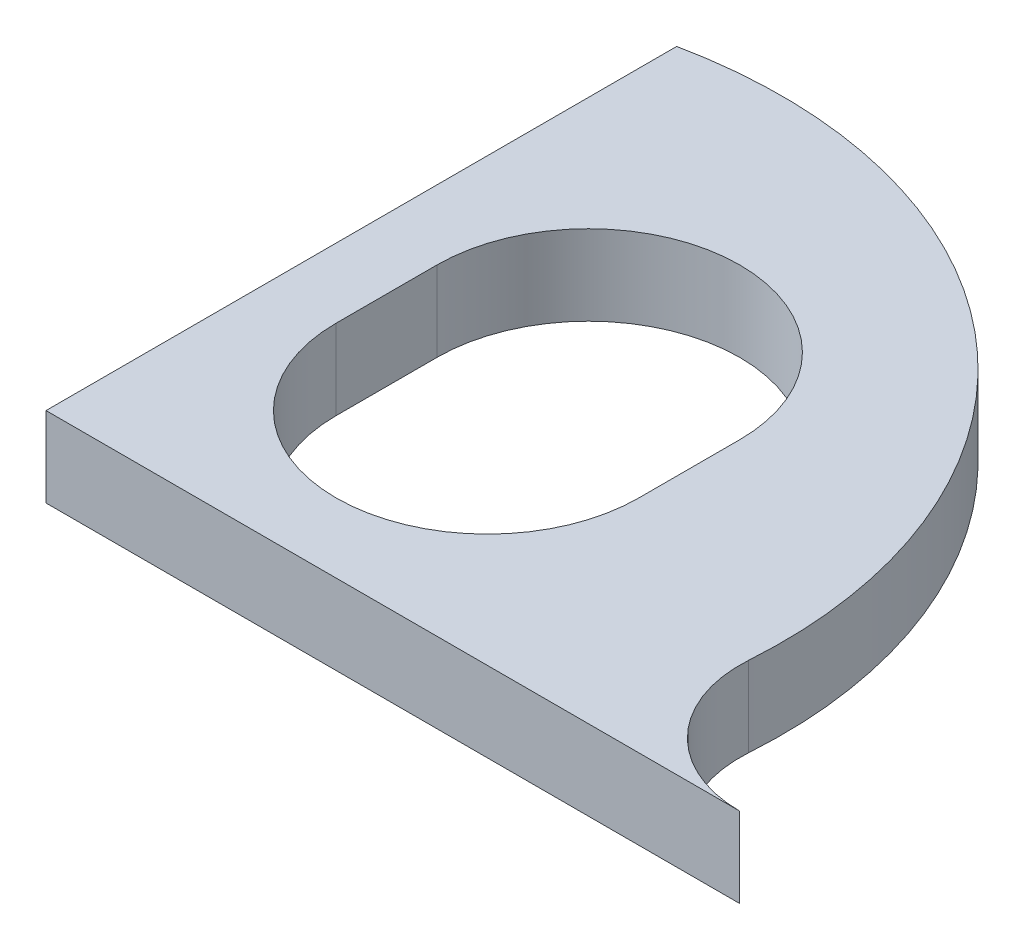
from build123d import *

# Parameters (mm, degrees)
BOSS_EXTRUDE1_DEPTH = 6.35


with BuildPart() as part:
    # Sketch1 → Boss-Extrude1 (new body)
    with BuildSketch(Plane(origin=(0, 0, 0), x_dir=(1, 0, 0), z_dir=(0, 1, 0))):
        with BuildLine():
            Line((0, 0), (45, 0))
            Line((45, 0), (55, 0))
            ThreePointArc((55, 0), (47.673810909, 3.182630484), (45, 10.709443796))
            ThreePointArc((45, 10.709443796), (32.251799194, 41.523588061), (0, 50))
            Line((0, 50), (0, 0))
        make_face()
        with BuildLine():
            Line((5.5, 17.5), (5.5, 25.5))
            ThreePointArc((5.5, 25.5), (17.5, 37.5), (29.5, 25.5))
            Line((29.5, 25.5), (29.5, 17.5))
            ThreePointArc((29.5, 17.5), (17.5, 5.5), (5.5, 17.5))
        make_face(mode=Mode.SUBTRACT)
    extrude(amount=BOSS_EXTRUDE1_DEPTH)


solid = part.part
